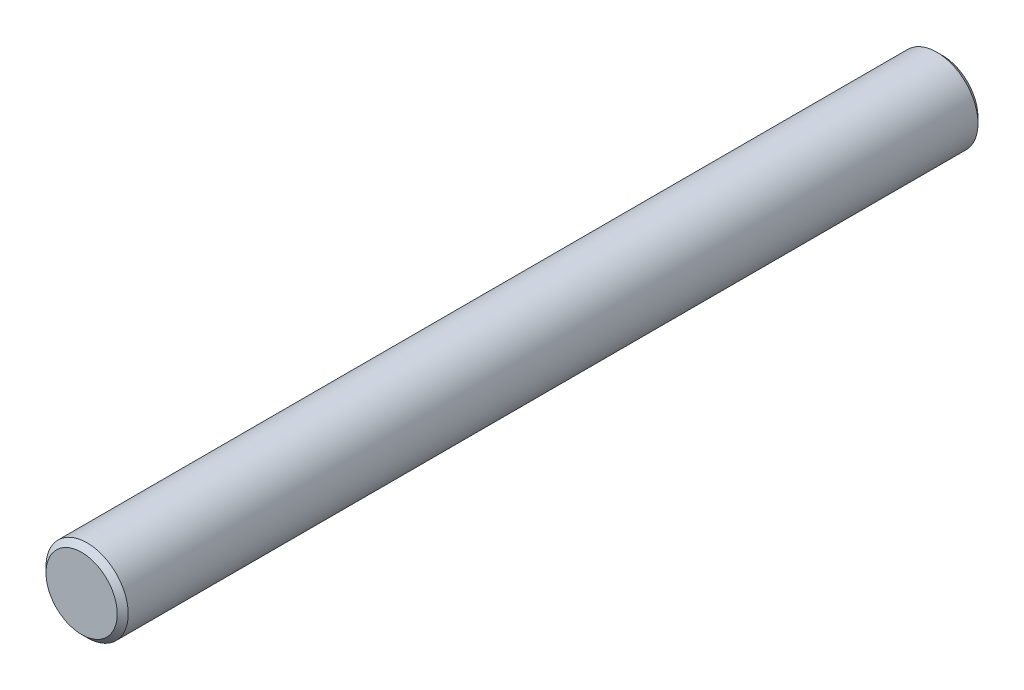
ISO-10303-21;
HEADER;
FILE_DESCRIPTION(('STEP AP214'),'2;1');
FILE_NAME('part.step','',(''),(''),'','','');
FILE_SCHEMA(('AUTOMOTIVE_DESIGN { 1 0 10303 214 1 1 1 1 }'));
ENDSEC;
DATA;
#1=APPLICATION_CONTEXT('core data for automotive mechanical design processes');
#2=APPLICATION_PROTOCOL_DEFINITION('international standard','automotive_design',2000,#1);
#3=PRODUCT_CONTEXT('',#1,'mechanical');
#4=PRODUCT('Part','Part','',(#3));
#5=PRODUCT_RELATED_PRODUCT_CATEGORY('part','',(#4));
#6=PRODUCT_DEFINITION_FORMATION('','',#4);
#7=PRODUCT_DEFINITION_CONTEXT('part definition',#1,'design');
#8=PRODUCT_DEFINITION('design','',#6,#7);
#9=PRODUCT_DEFINITION_SHAPE('','',#8);
#10=(LENGTH_UNIT() NAMED_UNIT(*) SI_UNIT(.MILLI.,.METRE.));
#11=(NAMED_UNIT(*) PLANE_ANGLE_UNIT() SI_UNIT($,.RADIAN.));
#12=(NAMED_UNIT(*) SI_UNIT($,.STERADIAN.) SOLID_ANGLE_UNIT());
#13=UNCERTAINTY_MEASURE_WITH_UNIT(LENGTH_MEASURE(1.E-05),#10,'distance_accuracy_value','');
#14=(GEOMETRIC_REPRESENTATION_CONTEXT(3) GLOBAL_UNCERTAINTY_ASSIGNED_CONTEXT((#13)) GLOBAL_UNIT_ASSIGNED_CONTEXT((#10,
#11,#12)) REPRESENTATION_CONTEXT('',''));
#15=CARTESIAN_POINT('',(0.,0.,0.));
#16=DIRECTION('',(0.,0.,1.));
#17=DIRECTION('',(1.,0.,0.));
#18=AXIS2_PLACEMENT_3D('',#15,#16,#17);
#19=CARTESIAN_POINT('',(0.,0.,31.4));
#20=DIRECTION('',(0.,0.,-1.));
#21=DIRECTION('',(-1.,0.,0.));
#22=AXIS2_PLACEMENT_3D('',#19,#20,#21);
#23=PLANE('',#22);
#24=CARTESIAN_POINT('',(0.,0.,31.400000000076));
#25=DIRECTION('',(0.,0.,-1.));
#26=DIRECTION('',(0.,1.,0.));
#27=AXIS2_PLACEMENT_3D('',#24,#25,#26);
#28=CIRCLE('',#27,1.30000000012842);
#29=CARTESIAN_POINT('',(0.,1.30000000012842,31.400000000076));
#30=VERTEX_POINT('',#29);
#31=EDGE_CURVE('E17',#30,#30,#28,.T.);
#32=ORIENTED_EDGE('',*,*,#31,.F.);
#33=EDGE_LOOP('',(#32));
#34=FACE_BOUND('',#33,.T.);
#35=ADVANCED_FACE('F13',(#34),#23,.F.);
#36=CARTESIAN_POINT('',(0.,0.,0.));
#37=DIRECTION('',(0.,0.,-1.));
#38=DIRECTION('',(-1.,0.,0.));
#39=AXIS2_PLACEMENT_3D('',#36,#37,#38);
#40=PLANE('',#39);
#41=CARTESIAN_POINT('',(0.,0.,-1.13686837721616E-10));
#42=DIRECTION('',(0.,0.,1.));
#43=DIRECTION('',(0.,-1.,0.));
#44=AXIS2_PLACEMENT_3D('',#41,#42,#43);
#45=CIRCLE('',#44,1.30000000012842);
#46=CARTESIAN_POINT('',(0.,-1.30000000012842,-1.1368684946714E-10));
#47=VERTEX_POINT('',#46);
#48=EDGE_CURVE('E26',#47,#47,#45,.T.);
#49=ORIENTED_EDGE('',*,*,#48,.F.);
#50=EDGE_LOOP('',(#49));
#51=FACE_BOUND('',#50,.T.);
#52=ADVANCED_FACE('F41',(#51),#40,.T.);
#53=CARTESIAN_POINT('',(0.,0.,31.1999999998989));
#54=DIRECTION('',(0.,0.,-1.));
#55=DIRECTION('',(0.,1.,0.));
#56=AXIS2_PLACEMENT_3D('',#53,#54,#55);
#57=CONICAL_SURFACE('',#56,1.49999999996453,0.785398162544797);
#58=CARTESIAN_POINT('',(0.,0.,31.2));
#59=DIRECTION('',(0.,0.,1.));
#60=DIRECTION('',(1.,0.,0.));
#61=AXIS2_PLACEMENT_3D('',#58,#59,#60);
#62=CIRCLE('',#61,1.5);
#63=CARTESIAN_POINT('',(1.5,0.,31.2));
#64=VERTEX_POINT('',#63);
#65=EDGE_CURVE('E21',#64,#64,#62,.F.);
#66=ORIENTED_EDGE('',*,*,#65,.F.);
#67=EDGE_LOOP('',(#66));
#68=FACE_BOUND('',#67,.T.);
#69=ORIENTED_EDGE('',*,*,#31,.T.);
#70=EDGE_LOOP('',(#69));
#71=FACE_BOUND('',#70,.T.);
#72=ADVANCED_FACE('F38',(#68,#71),#57,.T.);
#73=CARTESIAN_POINT('',(0.,0.,0.200000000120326));
#74=DIRECTION('',(0.,0.,1.));
#75=DIRECTION('',(0.,-1.,0.));
#76=AXIS2_PLACEMENT_3D('',#73,#74,#75);
#77=CONICAL_SURFACE('',#76,1.49999999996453,0.785398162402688);
#78=ORIENTED_EDGE('',*,*,#48,.T.);
#79=EDGE_LOOP('',(#78));
#80=FACE_BOUND('',#79,.T.);
#81=CARTESIAN_POINT('',(0.,0.,0.2));
#82=DIRECTION('',(0.,0.,1.));
#83=DIRECTION('',(1.,0.,0.));
#84=AXIS2_PLACEMENT_3D('',#81,#82,#83);
#85=CIRCLE('',#84,1.5);
#86=CARTESIAN_POINT('',(1.5,0.,0.2));
#87=VERTEX_POINT('',#86);
#88=EDGE_CURVE('E9',#87,#87,#85,.T.);
#89=ORIENTED_EDGE('',*,*,#88,.F.);
#90=EDGE_LOOP('',(#89));
#91=FACE_BOUND('',#90,.T.);
#92=ADVANCED_FACE('F50',(#80,#91),#77,.T.);
#93=CARTESIAN_POINT('',(0.,0.,0.));
#94=DIRECTION('',(0.,0.,1.));
#95=DIRECTION('',(1.,0.,0.));
#96=AXIS2_PLACEMENT_3D('',#93,#94,#95);
#97=CYLINDRICAL_SURFACE('',#96,1.5);
#98=ORIENTED_EDGE('',*,*,#88,.T.);
#99=EDGE_LOOP('',(#98));
#100=FACE_BOUND('',#99,.T.);
#101=ORIENTED_EDGE('',*,*,#65,.T.);
#102=EDGE_LOOP('',(#101));
#103=FACE_BOUND('',#102,.T.);
#104=ADVANCED_FACE('F15',(#100,#103),#97,.T.);
#105=CLOSED_SHELL('',(#35,#52,#72,#92,#104));
#106=MANIFOLD_SOLID_BREP('B1',#105);
#107=ADVANCED_BREP_SHAPE_REPRESENTATION('',(#18,#106),#14);
#108=SHAPE_DEFINITION_REPRESENTATION(#9,#107);
ENDSEC;
END-ISO-10303-21;
